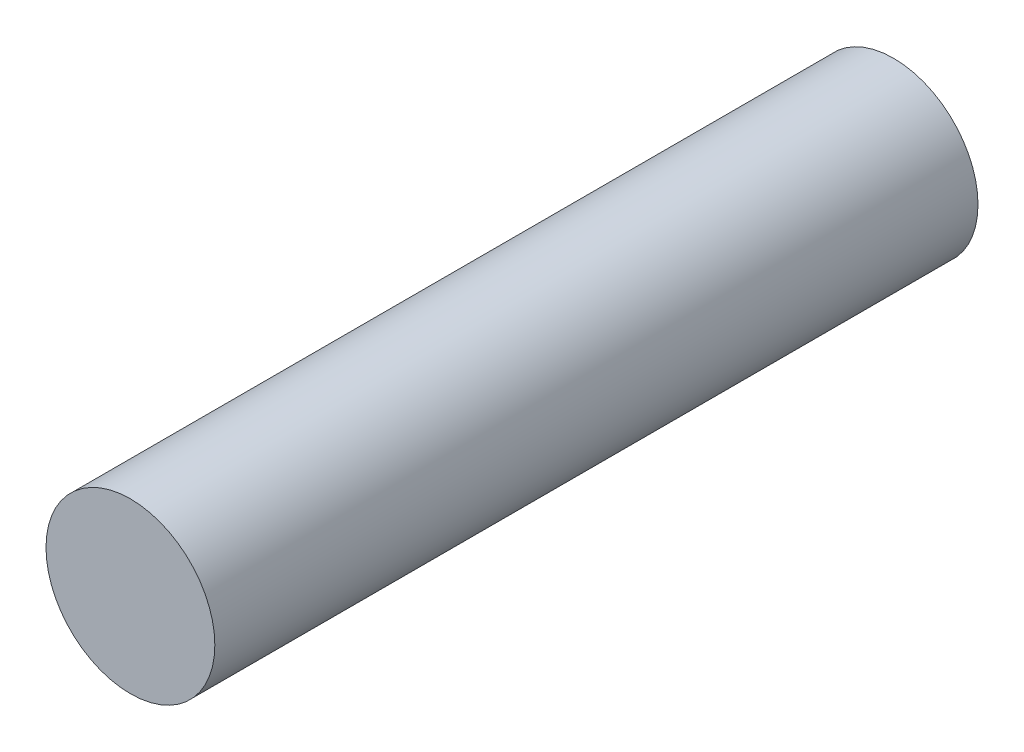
from build123d import *

# Parameters (mm, degrees)
SKETCH1_R      = 9.525
EXTRUDE1_DEPTH = 86.106


with BuildPart() as part:
    # Sketch1 → Extrude1 (new body)
    with BuildSketch(Plane.XY):
        Circle(SKETCH1_R)
    extrude(amount=EXTRUDE1_DEPTH)


solid = part.part
